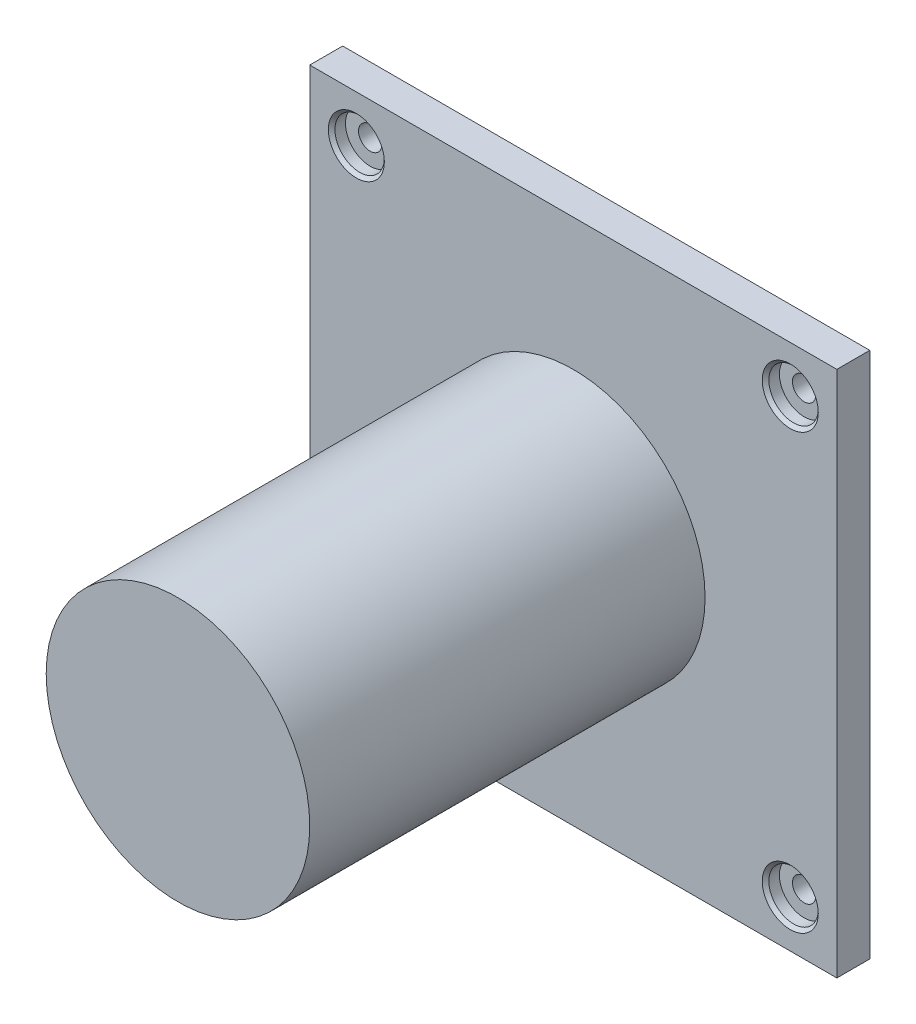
ISO-10303-21;
HEADER;
FILE_DESCRIPTION(('STEP AP214'),'2;1');
FILE_NAME('part.step','',(''),(''),'','','');
FILE_SCHEMA(('AUTOMOTIVE_DESIGN { 1 0 10303 214 1 1 1 1 }'));
ENDSEC;
DATA;
#1=APPLICATION_CONTEXT('core data for automotive mechanical design processes');
#2=APPLICATION_PROTOCOL_DEFINITION('international standard','automotive_design',2000,#1);
#3=PRODUCT_CONTEXT('',#1,'mechanical');
#4=PRODUCT('Part','Part','',(#3));
#5=PRODUCT_RELATED_PRODUCT_CATEGORY('part','',(#4));
#6=PRODUCT_DEFINITION_FORMATION('','',#4);
#7=PRODUCT_DEFINITION_CONTEXT('part definition',#1,'design');
#8=PRODUCT_DEFINITION('design','',#6,#7);
#9=PRODUCT_DEFINITION_SHAPE('','',#8);
#10=(LENGTH_UNIT() NAMED_UNIT(*) SI_UNIT(.MILLI.,.METRE.));
#11=(NAMED_UNIT(*) PLANE_ANGLE_UNIT() SI_UNIT($,.RADIAN.));
#12=(NAMED_UNIT(*) SI_UNIT($,.STERADIAN.) SOLID_ANGLE_UNIT());
#13=UNCERTAINTY_MEASURE_WITH_UNIT(LENGTH_MEASURE(1.E-05),#10,'distance_accuracy_value','');
#14=(GEOMETRIC_REPRESENTATION_CONTEXT(3) GLOBAL_UNCERTAINTY_ASSIGNED_CONTEXT((#13)) GLOBAL_UNIT_ASSIGNED_CONTEXT((#10,
#11,#12)) REPRESENTATION_CONTEXT('',''));
#15=CARTESIAN_POINT('',(0.,0.,0.));
#16=DIRECTION('',(0.,0.,1.));
#17=DIRECTION('',(1.,0.,0.));
#18=AXIS2_PLACEMENT_3D('',#15,#16,#17);
#19=CARTESIAN_POINT('',(0.,0.,6.35));
#20=DIRECTION('',(1.,0.,0.));
#21=DIRECTION('',(0.,0.,-1.));
#22=AXIS2_PLACEMENT_3D('',#19,#20,#21);
#23=PLANE('',#22);
#24=DIRECTION('',(0.,-1.,0.));
#25=VECTOR('',#24,1.);
#26=CARTESIAN_POINT('',(0.,0.,0.));
#27=LINE('',#26,#25);
#28=CARTESIAN_POINT('',(0.,101.6,0.));
#29=VERTEX_POINT('',#28);
#30=CARTESIAN_POINT('',(0.,0.,0.));
#31=VERTEX_POINT('',#30);
#32=EDGE_CURVE('E116',#29,#31,#27,.T.);
#33=ORIENTED_EDGE('',*,*,#32,.T.);
#34=DIRECTION('',(0.,0.,-1.));
#35=VECTOR('',#34,1.);
#36=CARTESIAN_POINT('',(0.,0.,6.35));
#37=LINE('',#36,#35);
#38=CARTESIAN_POINT('',(0.,0.,6.35));
#39=VERTEX_POINT('',#38);
#40=EDGE_CURVE('E48',#39,#31,#37,.T.);
#41=ORIENTED_EDGE('',*,*,#40,.F.);
#42=DIRECTION('',(0.,-1.,0.));
#43=VECTOR('',#42,1.);
#44=CARTESIAN_POINT('',(0.,0.,6.35));
#45=LINE('',#44,#43);
#46=CARTESIAN_POINT('',(0.,101.6,6.35));
#47=VERTEX_POINT('',#46);
#48=EDGE_CURVE('E99',#47,#39,#45,.T.);
#49=ORIENTED_EDGE('',*,*,#48,.F.);
#50=DIRECTION('',(0.,0.,-1.));
#51=VECTOR('',#50,1.);
#52=CARTESIAN_POINT('',(0.,101.6,6.35));
#53=LINE('',#52,#51);
#54=EDGE_CURVE('E112',#47,#29,#53,.T.);
#55=ORIENTED_EDGE('',*,*,#54,.T.);
#56=EDGE_LOOP('',(#33,#41,#49,#55));
#57=FACE_BOUND('',#56,.T.);
#58=ADVANCED_FACE('F45',(#57),#23,.F.);
#59=CARTESIAN_POINT('',(0.,0.,6.35));
#60=DIRECTION('',(0.,1.,0.));
#61=DIRECTION('',(0.,0.,1.));
#62=AXIS2_PLACEMENT_3D('',#59,#60,#61);
#63=PLANE('',#62);
#64=DIRECTION('',(1.,0.,0.));
#65=VECTOR('',#64,1.);
#66=CARTESIAN_POINT('',(0.,0.,0.));
#67=LINE('',#66,#65);
#68=CARTESIAN_POINT('',(101.6,0.,0.));
#69=VERTEX_POINT('',#68);
#70=EDGE_CURVE('E105',#31,#69,#67,.T.);
#71=ORIENTED_EDGE('',*,*,#70,.T.);
#72=DIRECTION('',(0.,0.,-1.));
#73=VECTOR('',#72,1.);
#74=CARTESIAN_POINT('',(101.6,0.,6.35));
#75=LINE('',#74,#73);
#76=CARTESIAN_POINT('',(101.6,0.,6.35));
#77=VERTEX_POINT('',#76);
#78=EDGE_CURVE('E103',#77,#69,#75,.T.);
#79=ORIENTED_EDGE('',*,*,#78,.F.);
#80=DIRECTION('',(1.,0.,0.));
#81=VECTOR('',#80,1.);
#82=CARTESIAN_POINT('',(0.,0.,6.35));
#83=LINE('',#82,#81);
#84=EDGE_CURVE('E94',#39,#77,#83,.T.);
#85=ORIENTED_EDGE('',*,*,#84,.F.);
#86=ORIENTED_EDGE('',*,*,#40,.T.);
#87=EDGE_LOOP('',(#71,#79,#85,#86));
#88=FACE_BOUND('',#87,.T.);
#89=ADVANCED_FACE('F104',(#88),#63,.F.);
#90=CARTESIAN_POINT('',(101.6,0.,6.35));
#91=DIRECTION('',(-1.,0.,0.));
#92=DIRECTION('',(0.,0.,1.));
#93=AXIS2_PLACEMENT_3D('',#90,#91,#92);
#94=PLANE('',#93);
#95=DIRECTION('',(0.,1.,0.));
#96=VECTOR('',#95,1.);
#97=CARTESIAN_POINT('',(101.6,0.,0.));
#98=LINE('',#97,#96);
#99=CARTESIAN_POINT('',(101.6,101.6,0.));
#100=VERTEX_POINT('',#99);
#101=EDGE_CURVE('E80',#69,#100,#98,.T.);
#102=ORIENTED_EDGE('',*,*,#101,.T.);
#103=DIRECTION('',(0.,0.,-1.));
#104=VECTOR('',#103,1.);
#105=CARTESIAN_POINT('',(101.6,101.6,6.35));
#106=LINE('',#105,#104);
#107=CARTESIAN_POINT('',(101.6,101.6,6.35));
#108=VERTEX_POINT('',#107);
#109=EDGE_CURVE('E107',#108,#100,#106,.T.);
#110=ORIENTED_EDGE('',*,*,#109,.F.);
#111=DIRECTION('',(0.,1.,0.));
#112=VECTOR('',#111,1.);
#113=CARTESIAN_POINT('',(101.6,0.,6.35));
#114=LINE('',#113,#112);
#115=EDGE_CURVE('E97',#77,#108,#114,.T.);
#116=ORIENTED_EDGE('',*,*,#115,.F.);
#117=ORIENTED_EDGE('',*,*,#78,.T.);
#118=EDGE_LOOP('',(#102,#110,#116,#117));
#119=FACE_BOUND('',#118,.T.);
#120=ADVANCED_FACE('F108',(#119),#94,.F.);
#121=CARTESIAN_POINT('',(0.,101.6,6.35));
#122=DIRECTION('',(0.,-1.,0.));
#123=DIRECTION('',(0.,0.,-1.));
#124=AXIS2_PLACEMENT_3D('',#121,#122,#123);
#125=PLANE('',#124);
#126=DIRECTION('',(-1.,0.,0.));
#127=VECTOR('',#126,1.);
#128=CARTESIAN_POINT('',(0.,101.6,0.));
#129=LINE('',#128,#127);
#130=EDGE_CURVE('E86',#100,#29,#129,.T.);
#131=ORIENTED_EDGE('',*,*,#130,.T.);
#132=ORIENTED_EDGE('',*,*,#54,.F.);
#133=DIRECTION('',(-1.,0.,0.));
#134=VECTOR('',#133,1.);
#135=CARTESIAN_POINT('',(0.,101.6,6.35));
#136=LINE('',#135,#134);
#137=EDGE_CURVE('E63',#108,#47,#136,.T.);
#138=ORIENTED_EDGE('',*,*,#137,.F.);
#139=ORIENTED_EDGE('',*,*,#109,.T.);
#140=EDGE_LOOP('',(#131,#132,#138,#139));
#141=FACE_BOUND('',#140,.T.);
#142=ADVANCED_FACE('F130',(#141),#125,.F.);
#143=CARTESIAN_POINT('',(0.,0.,6.35));
#144=DIRECTION('',(0.,0.,-1.));
#145=DIRECTION('',(-1.,0.,0.));
#146=AXIS2_PLACEMENT_3D('',#143,#144,#145);
#147=PLANE('',#146);
#148=CARTESIAN_POINT('',(8.98025612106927,92.619743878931,6.35));
#149=DIRECTION('',(0.,0.,1.));
#150=DIRECTION('',(1.,0.,0.));
#151=AXIS2_PLACEMENT_3D('',#148,#149,#150);
#152=CIRCLE('',#151,5.3975);
#153=CARTESIAN_POINT('',(14.3777561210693,92.619743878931,6.35));
#154=VERTEX_POINT('',#153);
#155=EDGE_CURVE('E216',#154,#154,#152,.T.);
#156=ORIENTED_EDGE('',*,*,#155,.F.);
#157=EDGE_LOOP('',(#156));
#158=FACE_BOUND('',#157,.T.);
#159=CARTESIAN_POINT('',(92.6197438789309,92.6197438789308,6.35));
#160=DIRECTION('',(0.,0.,1.));
#161=DIRECTION('',(1.,0.,0.));
#162=AXIS2_PLACEMENT_3D('',#159,#160,#161);
#163=CIRCLE('',#162,5.3975);
#164=CARTESIAN_POINT('',(98.0172438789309,92.6197438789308,6.35));
#165=VERTEX_POINT('',#164);
#166=EDGE_CURVE('E196',#165,#165,#163,.T.);
#167=ORIENTED_EDGE('',*,*,#166,.F.);
#168=EDGE_LOOP('',(#167));
#169=FACE_BOUND('',#168,.T.);
#170=CARTESIAN_POINT('',(8.98025612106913,8.98025612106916,6.35));
#171=DIRECTION('',(0.,0.,1.));
#172=DIRECTION('',(1.,0.,0.));
#173=AXIS2_PLACEMENT_3D('',#170,#171,#172);
#174=CIRCLE('',#173,5.3975);
#175=CARTESIAN_POINT('',(14.3777561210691,8.98025612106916,6.35));
#176=VERTEX_POINT('',#175);
#177=EDGE_CURVE('E176',#176,#176,#174,.T.);
#178=ORIENTED_EDGE('',*,*,#177,.F.);
#179=EDGE_LOOP('',(#178));
#180=FACE_BOUND('',#179,.T.);
#181=CARTESIAN_POINT('',(92.6197438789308,8.9802561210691,6.35));
#182=DIRECTION('',(0.,0.,1.));
#183=DIRECTION('',(1.,0.,0.));
#184=AXIS2_PLACEMENT_3D('',#181,#182,#183);
#185=CIRCLE('',#184,5.3975);
#186=CARTESIAN_POINT('',(98.0172438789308,8.9802561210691,6.35));
#187=VERTEX_POINT('',#186);
#188=EDGE_CURVE('E156',#187,#187,#185,.T.);
#189=ORIENTED_EDGE('',*,*,#188,.F.);
#190=EDGE_LOOP('',(#189));
#191=FACE_BOUND('',#190,.T.);
#192=CARTESIAN_POINT('',(50.8,50.8,6.35));
#193=DIRECTION('',(0.,0.,1.));
#194=DIRECTION('',(1.,0.,0.));
#195=AXIS2_PLACEMENT_3D('',#192,#193,#194);
#196=CIRCLE('',#195,25.4);
#197=CARTESIAN_POINT('',(25.4,50.8,6.34999999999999));
#198=VERTEX_POINT('',#197);
#199=EDGE_CURVE('E11',#198,#198,#196,.T.);
#200=ORIENTED_EDGE('',*,*,#199,.F.);
#201=EDGE_LOOP('',(#200));
#202=FACE_BOUND('',#201,.T.);
#203=ORIENTED_EDGE('',*,*,#48,.T.);
#204=ORIENTED_EDGE('',*,*,#84,.T.);
#205=ORIENTED_EDGE('',*,*,#115,.T.);
#206=ORIENTED_EDGE('',*,*,#137,.T.);
#207=EDGE_LOOP('',(#203,#204,#205,#206));
#208=FACE_BOUND('',#207,.T.);
#209=ADVANCED_FACE('F95',(#158,#169,#180,#191,#202,#208),#147,.F.);
#210=CARTESIAN_POINT('',(0.,0.,0.));
#211=DIRECTION('',(0.,0.,-1.));
#212=DIRECTION('',(-1.,0.,0.));
#213=AXIS2_PLACEMENT_3D('',#210,#211,#212);
#214=PLANE('',#213);
#215=CARTESIAN_POINT('',(8.98025612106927,92.619743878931,0.));
#216=DIRECTION('',(0.,0.,1.));
#217=DIRECTION('',(1.,0.,0.));
#218=AXIS2_PLACEMENT_3D('',#215,#216,#217);
#219=CIRCLE('',#218,2.2479);
#220=CARTESIAN_POINT('',(11.2281561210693,92.619743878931,0.));
#221=VERTEX_POINT('',#220);
#222=EDGE_CURVE('E200',#221,#221,#219,.T.);
#223=ORIENTED_EDGE('',*,*,#222,.T.);
#224=EDGE_LOOP('',(#223));
#225=FACE_BOUND('',#224,.T.);
#226=CARTESIAN_POINT('',(92.6197438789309,92.6197438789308,0.));
#227=DIRECTION('',(0.,0.,1.));
#228=DIRECTION('',(1.,0.,0.));
#229=AXIS2_PLACEMENT_3D('',#226,#227,#228);
#230=CIRCLE('',#229,2.2479);
#231=CARTESIAN_POINT('',(94.8676438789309,92.6197438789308,0.));
#232=VERTEX_POINT('',#231);
#233=EDGE_CURVE('E180',#232,#232,#230,.T.);
#234=ORIENTED_EDGE('',*,*,#233,.T.);
#235=EDGE_LOOP('',(#234));
#236=FACE_BOUND('',#235,.T.);
#237=CARTESIAN_POINT('',(8.98025612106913,8.98025612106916,0.));
#238=DIRECTION('',(0.,0.,1.));
#239=DIRECTION('',(1.,0.,0.));
#240=AXIS2_PLACEMENT_3D('',#237,#238,#239);
#241=CIRCLE('',#240,2.2479);
#242=CARTESIAN_POINT('',(11.2281561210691,8.98025612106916,0.));
#243=VERTEX_POINT('',#242);
#244=EDGE_CURVE('E160',#243,#243,#241,.T.);
#245=ORIENTED_EDGE('',*,*,#244,.T.);
#246=EDGE_LOOP('',(#245));
#247=FACE_BOUND('',#246,.T.);
#248=CARTESIAN_POINT('',(92.6197438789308,8.9802561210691,0.));
#249=DIRECTION('',(0.,0.,1.));
#250=DIRECTION('',(1.,0.,0.));
#251=AXIS2_PLACEMENT_3D('',#248,#249,#250);
#252=CIRCLE('',#251,2.2479);
#253=CARTESIAN_POINT('',(94.8676438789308,8.9802561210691,0.));
#254=VERTEX_POINT('',#253);
#255=EDGE_CURVE('E140',#254,#254,#252,.T.);
#256=ORIENTED_EDGE('',*,*,#255,.T.);
#257=EDGE_LOOP('',(#256));
#258=FACE_BOUND('',#257,.T.);
#259=ORIENTED_EDGE('',*,*,#32,.F.);
#260=ORIENTED_EDGE('',*,*,#130,.F.);
#261=ORIENTED_EDGE('',*,*,#101,.F.);
#262=ORIENTED_EDGE('',*,*,#70,.F.);
#263=EDGE_LOOP('',(#259,#260,#261,#262));
#264=FACE_BOUND('',#263,.T.);
#265=ADVANCED_FACE('F133',(#225,#236,#247,#258,#264),#214,.T.);
#266=CARTESIAN_POINT('',(50.8,50.8,82.55));
#267=DIRECTION('',(0.,0.,-1.));
#268=DIRECTION('',(-1.,0.,0.));
#269=AXIS2_PLACEMENT_3D('',#266,#267,#268);
#270=CYLINDRICAL_SURFACE('',#269,25.4);
#271=CARTESIAN_POINT('',(50.8,50.8,82.55));
#272=DIRECTION('',(0.,0.,1.));
#273=DIRECTION('',(1.,0.,0.));
#274=AXIS2_PLACEMENT_3D('',#271,#272,#273);
#275=CIRCLE('',#274,25.4);
#276=CARTESIAN_POINT('',(25.4,50.8,82.55));
#277=VERTEX_POINT('',#276);
#278=EDGE_CURVE('E120',#277,#277,#275,.T.);
#279=CARTESIAN_POINT('',(25.4,50.8,82.55));
#280=CARTESIAN_POINT('',(25.4,50.8,81.75625));
#281=CARTESIAN_POINT('',(25.4,50.8,80.9625));
#282=CARTESIAN_POINT('',(25.4,50.8,79.375));
#283=CARTESIAN_POINT('',(25.4,50.8,78.58125));
#284=CARTESIAN_POINT('',(25.4,50.8,76.99375));
#285=CARTESIAN_POINT('',(25.4,50.8,76.2));
#286=CARTESIAN_POINT('',(25.4,50.8,74.6125));
#287=CARTESIAN_POINT('',(25.4,50.8,73.81875));
#288=CARTESIAN_POINT('',(25.4,50.8,72.23125));
#289=CARTESIAN_POINT('',(25.4,50.8,71.4375));
#290=CARTESIAN_POINT('',(25.4,50.8,69.85));
#291=CARTESIAN_POINT('',(25.4,50.8,69.05625));
#292=CARTESIAN_POINT('',(25.4,50.8,67.46875));
#293=CARTESIAN_POINT('',(25.4,50.8,66.675));
#294=CARTESIAN_POINT('',(25.4,50.8,65.0875));
#295=CARTESIAN_POINT('',(25.4,50.8,64.29375));
#296=CARTESIAN_POINT('',(25.4,50.8,62.70625));
#297=CARTESIAN_POINT('',(25.4,50.8,61.9125));
#298=CARTESIAN_POINT('',(25.4,50.8,60.325));
#299=CARTESIAN_POINT('',(25.4,50.8,59.53125));
#300=CARTESIAN_POINT('',(25.4,50.8,57.94375));
#301=CARTESIAN_POINT('',(25.4,50.8,57.15));
#302=CARTESIAN_POINT('',(25.4,50.8,55.5625));
#303=CARTESIAN_POINT('',(25.4,50.8,54.76875));
#304=CARTESIAN_POINT('',(25.4,50.8,53.18125));
#305=CARTESIAN_POINT('',(25.4,50.8,52.3875));
#306=CARTESIAN_POINT('',(25.4,50.8,50.8));
#307=CARTESIAN_POINT('',(25.4,50.8,50.00625));
#308=CARTESIAN_POINT('',(25.4,50.8,48.41875));
#309=CARTESIAN_POINT('',(25.4,50.8,47.625));
#310=CARTESIAN_POINT('',(25.4,50.8,46.0375));
#311=CARTESIAN_POINT('',(25.4,50.8,45.24375));
#312=CARTESIAN_POINT('',(25.4,50.8,43.65625));
#313=CARTESIAN_POINT('',(25.4,50.8,42.8625));
#314=CARTESIAN_POINT('',(25.4,50.8,41.275));
#315=CARTESIAN_POINT('',(25.4,50.8,40.48125));
#316=CARTESIAN_POINT('',(25.4,50.8,38.89375));
#317=CARTESIAN_POINT('',(25.4,50.8,38.1));
#318=CARTESIAN_POINT('',(25.4,50.8,36.5125));
#319=CARTESIAN_POINT('',(25.4,50.8,35.71875));
#320=CARTESIAN_POINT('',(25.4,50.8,34.13125));
#321=CARTESIAN_POINT('',(25.4,50.8,33.3375));
#322=CARTESIAN_POINT('',(25.4,50.8,31.75));
#323=CARTESIAN_POINT('',(25.4,50.8,30.95625));
#324=CARTESIAN_POINT('',(25.4,50.8,29.36875));
#325=CARTESIAN_POINT('',(25.4,50.8,28.575));
#326=CARTESIAN_POINT('',(25.4,50.8,26.9875));
#327=CARTESIAN_POINT('',(25.4,50.8,26.19375));
#328=CARTESIAN_POINT('',(25.4,50.8,24.60625));
#329=CARTESIAN_POINT('',(25.4,50.8,23.8125));
#330=CARTESIAN_POINT('',(25.4,50.8,22.225));
#331=CARTESIAN_POINT('',(25.4,50.8,21.43125));
#332=CARTESIAN_POINT('',(25.4,50.8,19.84375));
#333=CARTESIAN_POINT('',(25.4,50.8,19.05));
#334=CARTESIAN_POINT('',(25.4,50.8,17.4625));
#335=CARTESIAN_POINT('',(25.4,50.8,16.66875));
#336=CARTESIAN_POINT('',(25.4,50.8,15.08125));
#337=CARTESIAN_POINT('',(25.4,50.8,14.2875));
#338=CARTESIAN_POINT('',(25.4,50.8,12.7));
#339=CARTESIAN_POINT('',(25.4,50.8,11.90625));
#340=CARTESIAN_POINT('',(25.4,50.8,10.31875));
#341=CARTESIAN_POINT('',(25.4,50.8,9.525));
#342=CARTESIAN_POINT('',(25.4,50.8,7.93749999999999));
#343=CARTESIAN_POINT('',(25.4,50.8,7.14375));
#344=CARTESIAN_POINT('',(25.4,50.8,6.34999999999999));
#345=B_SPLINE_CURVE_WITH_KNOTS('',3,(#279,#280,#281,#282,#283,#284,#285,#286,#287,#288,#289,
#290,#291,#292,#293,#294,#295,#296,#297,#298,#299,#300,#301,#302,#303,#304,#305,#306,#307,#308,
#309,#310,#311,#312,#313,#314,#315,#316,#317,#318,#319,#320,#321,#322,#323,#324,#325,#326,#327,
#328,#329,#330,#331,#332,#333,#334,#335,#336,#337,#338,#339,#340,#341,#342,#343,#344),
.UNSPECIFIED.,.F.,.F.,(4,2,2,2,2,2,2,2,2,2,2,2,2,2,2,2,2,2,2,2,2,2,2,2,2,2,2,2,2,2,2,2,4),(0.,
2.38125,4.7625,7.14375,9.52500000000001,11.90625,14.2875,16.66875,19.05,21.43125,23.8125,
26.19375,28.575,30.95625,33.3375,35.71875,38.1,40.48125,42.8625,45.24375,47.625,50.00625,
52.3875,54.76875,57.15,59.53125,61.9125,64.29375,66.675,69.05625,71.4375,73.81875,76.2),.UNSPECIFIED.);
#346=EDGE_CURVE('BSEAM234',#277,#198,#345,.T.);
#347=ORIENTED_EDGE('',*,*,#278,.F.);
#348=ORIENTED_EDGE('',*,*,#199,.T.);
#349=ORIENTED_EDGE('',*,*,#346,.T.);
#350=ORIENTED_EDGE('',*,*,#346,.F.);
#351=EDGE_LOOP('',(#347,#349,#348,#350));
#352=FACE_BOUND('',#351,.T.);
#353=ADVANCED_FACE('F234',(#352),#270,.T.);
#354=CARTESIAN_POINT('',(50.8,50.8,82.55));
#355=DIRECTION('',(0.,0.,1.));
#356=DIRECTION('',(1.,0.,0.));
#357=AXIS2_PLACEMENT_3D('',#354,#355,#356);
#358=PLANE('',#357);
#359=ORIENTED_EDGE('',*,*,#278,.T.);
#360=EDGE_LOOP('',(#359));
#361=FACE_BOUND('',#360,.T.);
#362=ADVANCED_FACE('F236',(#361),#358,.T.);
#363=CARTESIAN_POINT('',(92.6197438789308,8.9802561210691,6.35));
#364=DIRECTION('',(0.,0.,1.));
#365=DIRECTION('',(1.,0.,0.));
#366=AXIS2_PLACEMENT_3D('',#363,#364,#365);
#367=CYLINDRICAL_SURFACE('',#366,2.2479);
#368=ORIENTED_EDGE('',*,*,#255,.F.);
#369=EDGE_LOOP('',(#368));
#370=FACE_BOUND('',#369,.T.);
#371=CARTESIAN_POINT('',(92.6197438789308,8.9802561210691,3.683));
#372=DIRECTION('',(0.,0.,1.));
#373=DIRECTION('',(1.,0.,0.));
#374=AXIS2_PLACEMENT_3D('',#371,#372,#373);
#375=CIRCLE('',#374,2.2479);
#376=CARTESIAN_POINT('',(94.8676438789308,8.9802561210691,3.683));
#377=VERTEX_POINT('',#376);
#378=EDGE_CURVE('E144',#377,#377,#375,.T.);
#379=ORIENTED_EDGE('',*,*,#378,.T.);
#380=EDGE_LOOP('',(#379));
#381=FACE_BOUND('',#380,.T.);
#382=ADVANCED_FACE('F243',(#370,#381),#367,.F.);
#383=CARTESIAN_POINT('',(97.3822438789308,8.9802561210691,3.683));
#384=DIRECTION('',(0.,0.,-1.));
#385=DIRECTION('',(-1.,0.,0.));
#386=AXIS2_PLACEMENT_3D('',#383,#384,#385);
#387=PLANE('',#386);
#388=ORIENTED_EDGE('',*,*,#378,.F.);
#389=EDGE_LOOP('',(#388));
#390=FACE_BOUND('',#389,.T.);
#391=CARTESIAN_POINT('',(92.6197438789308,8.9802561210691,3.683));
#392=DIRECTION('',(0.,0.,1.));
#393=DIRECTION('',(1.,0.,0.));
#394=AXIS2_PLACEMENT_3D('',#391,#392,#393);
#395=CIRCLE('',#394,4.7625);
#396=CARTESIAN_POINT('',(97.3822438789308,8.9802561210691,3.683));
#397=VERTEX_POINT('',#396);
#398=EDGE_CURVE('E148',#397,#397,#395,.T.);
#399=ORIENTED_EDGE('',*,*,#398,.T.);
#400=EDGE_LOOP('',(#399));
#401=FACE_BOUND('',#400,.T.);
#402=ADVANCED_FACE('F303',(#390,#401),#387,.F.);
#403=CARTESIAN_POINT('',(92.6197438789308,8.9802561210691,6.35));
#404=DIRECTION('',(0.,0.,1.));
#405=DIRECTION('',(1.,0.,0.));
#406=AXIS2_PLACEMENT_3D('',#403,#404,#405);
#407=CYLINDRICAL_SURFACE('',#406,4.7625);
#408=ORIENTED_EDGE('',*,*,#398,.F.);
#409=EDGE_LOOP('',(#408));
#410=FACE_BOUND('',#409,.T.);
#411=CARTESIAN_POINT('',(92.6197438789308,8.9802561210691,5.715));
#412=DIRECTION('',(0.,0.,1.));
#413=DIRECTION('',(1.,0.,0.));
#414=AXIS2_PLACEMENT_3D('',#411,#412,#413);
#415=CIRCLE('',#414,4.7625);
#416=CARTESIAN_POINT('',(97.3822438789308,8.9802561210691,5.715));
#417=VERTEX_POINT('',#416);
#418=EDGE_CURVE('E152',#417,#417,#415,.T.);
#419=ORIENTED_EDGE('',*,*,#418,.T.);
#420=EDGE_LOOP('',(#419));
#421=FACE_BOUND('',#420,.T.);
#422=ADVANCED_FACE('F312',(#410,#421),#407,.F.);
#423=CARTESIAN_POINT('',(92.6197438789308,8.9802561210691,6.35));
#424=DIRECTION('',(0.,0.,1.));
#425=DIRECTION('',(1.,0.,0.));
#426=AXIS2_PLACEMENT_3D('',#423,#424,#425);
#427=CONICAL_SURFACE('',#426,5.3975,0.785398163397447);
#428=ORIENTED_EDGE('',*,*,#418,.F.);
#429=EDGE_LOOP('',(#428));
#430=FACE_BOUND('',#429,.T.);
#431=ORIENTED_EDGE('',*,*,#188,.T.);
#432=EDGE_LOOP('',(#431));
#433=FACE_BOUND('',#432,.T.);
#434=ADVANCED_FACE('F321',(#430,#433),#427,.F.);
#435=CARTESIAN_POINT('',(8.98025612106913,8.98025612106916,6.35));
#436=DIRECTION('',(0.,0.,1.));
#437=DIRECTION('',(1.,0.,0.));
#438=AXIS2_PLACEMENT_3D('',#435,#436,#437);
#439=CYLINDRICAL_SURFACE('',#438,2.2479);
#440=ORIENTED_EDGE('',*,*,#244,.F.);
#441=EDGE_LOOP('',(#440));
#442=FACE_BOUND('',#441,.T.);
#443=CARTESIAN_POINT('',(8.98025612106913,8.98025612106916,3.683));
#444=DIRECTION('',(0.,0.,1.));
#445=DIRECTION('',(1.,0.,0.));
#446=AXIS2_PLACEMENT_3D('',#443,#444,#445);
#447=CIRCLE('',#446,2.2479);
#448=CARTESIAN_POINT('',(11.2281561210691,8.98025612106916,3.683));
#449=VERTEX_POINT('',#448);
#450=EDGE_CURVE('E164',#449,#449,#447,.T.);
#451=ORIENTED_EDGE('',*,*,#450,.T.);
#452=EDGE_LOOP('',(#451));
#453=FACE_BOUND('',#452,.T.);
#454=ADVANCED_FACE('F330',(#442,#453),#439,.F.);
#455=CARTESIAN_POINT('',(13.7427561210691,8.98025612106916,3.683));
#456=DIRECTION('',(0.,0.,-1.));
#457=DIRECTION('',(-1.,0.,0.));
#458=AXIS2_PLACEMENT_3D('',#455,#456,#457);
#459=PLANE('',#458);
#460=ORIENTED_EDGE('',*,*,#450,.F.);
#461=EDGE_LOOP('',(#460));
#462=FACE_BOUND('',#461,.T.);
#463=CARTESIAN_POINT('',(8.98025612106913,8.98025612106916,3.683));
#464=DIRECTION('',(0.,0.,1.));
#465=DIRECTION('',(1.,0.,0.));
#466=AXIS2_PLACEMENT_3D('',#463,#464,#465);
#467=CIRCLE('',#466,4.7625);
#468=CARTESIAN_POINT('',(13.7427561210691,8.98025612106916,3.683));
#469=VERTEX_POINT('',#468);
#470=EDGE_CURVE('E168',#469,#469,#467,.T.);
#471=ORIENTED_EDGE('',*,*,#470,.T.);
#472=EDGE_LOOP('',(#471));
#473=FACE_BOUND('',#472,.T.);
#474=ADVANCED_FACE('F339',(#462,#473),#459,.F.);
#475=CARTESIAN_POINT('',(8.98025612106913,8.98025612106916,6.35));
#476=DIRECTION('',(0.,0.,1.));
#477=DIRECTION('',(1.,0.,0.));
#478=AXIS2_PLACEMENT_3D('',#475,#476,#477);
#479=CYLINDRICAL_SURFACE('',#478,4.7625);
#480=ORIENTED_EDGE('',*,*,#470,.F.);
#481=EDGE_LOOP('',(#480));
#482=FACE_BOUND('',#481,.T.);
#483=CARTESIAN_POINT('',(8.98025612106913,8.98025612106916,5.715));
#484=DIRECTION('',(0.,0.,1.));
#485=DIRECTION('',(1.,0.,0.));
#486=AXIS2_PLACEMENT_3D('',#483,#484,#485);
#487=CIRCLE('',#486,4.7625);
#488=CARTESIAN_POINT('',(13.7427561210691,8.98025612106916,5.715));
#489=VERTEX_POINT('',#488);
#490=EDGE_CURVE('E172',#489,#489,#487,.T.);
#491=ORIENTED_EDGE('',*,*,#490,.T.);
#492=EDGE_LOOP('',(#491));
#493=FACE_BOUND('',#492,.T.);
#494=ADVANCED_FACE('F348',(#482,#493),#479,.F.);
#495=CARTESIAN_POINT('',(8.98025612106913,8.98025612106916,6.35));
#496=DIRECTION('',(0.,0.,1.));
#497=DIRECTION('',(1.,0.,0.));
#498=AXIS2_PLACEMENT_3D('',#495,#496,#497);
#499=CONICAL_SURFACE('',#498,5.3975,0.785398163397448);
#500=ORIENTED_EDGE('',*,*,#490,.F.);
#501=EDGE_LOOP('',(#500));
#502=FACE_BOUND('',#501,.T.);
#503=ORIENTED_EDGE('',*,*,#177,.T.);
#504=EDGE_LOOP('',(#503));
#505=FACE_BOUND('',#504,.T.);
#506=ADVANCED_FACE('F357',(#502,#505),#499,.F.);
#507=CARTESIAN_POINT('',(92.6197438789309,92.6197438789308,6.35));
#508=DIRECTION('',(0.,0.,1.));
#509=DIRECTION('',(1.,0.,0.));
#510=AXIS2_PLACEMENT_3D('',#507,#508,#509);
#511=CYLINDRICAL_SURFACE('',#510,2.2479);
#512=ORIENTED_EDGE('',*,*,#233,.F.);
#513=EDGE_LOOP('',(#512));
#514=FACE_BOUND('',#513,.T.);
#515=CARTESIAN_POINT('',(92.6197438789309,92.6197438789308,3.683));
#516=DIRECTION('',(0.,0.,1.));
#517=DIRECTION('',(1.,0.,0.));
#518=AXIS2_PLACEMENT_3D('',#515,#516,#517);
#519=CIRCLE('',#518,2.2479);
#520=CARTESIAN_POINT('',(94.8676438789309,92.6197438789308,3.683));
#521=VERTEX_POINT('',#520);
#522=EDGE_CURVE('E184',#521,#521,#519,.T.);
#523=ORIENTED_EDGE('',*,*,#522,.T.);
#524=EDGE_LOOP('',(#523));
#525=FACE_BOUND('',#524,.T.);
#526=ADVANCED_FACE('F366',(#514,#525),#511,.F.);
#527=CARTESIAN_POINT('',(97.3822438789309,92.6197438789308,3.683));
#528=DIRECTION('',(0.,0.,-1.));
#529=DIRECTION('',(-1.,0.,0.));
#530=AXIS2_PLACEMENT_3D('',#527,#528,#529);
#531=PLANE('',#530);
#532=ORIENTED_EDGE('',*,*,#522,.F.);
#533=EDGE_LOOP('',(#532));
#534=FACE_BOUND('',#533,.T.);
#535=CARTESIAN_POINT('',(92.6197438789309,92.6197438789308,3.683));
#536=DIRECTION('',(0.,0.,1.));
#537=DIRECTION('',(1.,0.,0.));
#538=AXIS2_PLACEMENT_3D('',#535,#536,#537);
#539=CIRCLE('',#538,4.7625);
#540=CARTESIAN_POINT('',(97.3822438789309,92.6197438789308,3.683));
#541=VERTEX_POINT('',#540);
#542=EDGE_CURVE('E188',#541,#541,#539,.T.);
#543=ORIENTED_EDGE('',*,*,#542,.T.);
#544=EDGE_LOOP('',(#543));
#545=FACE_BOUND('',#544,.T.);
#546=ADVANCED_FACE('F375',(#534,#545),#531,.F.);
#547=CARTESIAN_POINT('',(92.6197438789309,92.6197438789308,6.35));
#548=DIRECTION('',(0.,0.,1.));
#549=DIRECTION('',(1.,0.,0.));
#550=AXIS2_PLACEMENT_3D('',#547,#548,#549);
#551=CYLINDRICAL_SURFACE('',#550,4.7625);
#552=ORIENTED_EDGE('',*,*,#542,.F.);
#553=EDGE_LOOP('',(#552));
#554=FACE_BOUND('',#553,.T.);
#555=CARTESIAN_POINT('',(92.6197438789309,92.6197438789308,5.715));
#556=DIRECTION('',(0.,0.,1.));
#557=DIRECTION('',(1.,0.,0.));
#558=AXIS2_PLACEMENT_3D('',#555,#556,#557);
#559=CIRCLE('',#558,4.7625);
#560=CARTESIAN_POINT('',(97.3822438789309,92.6197438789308,5.715));
#561=VERTEX_POINT('',#560);
#562=EDGE_CURVE('E192',#561,#561,#559,.T.);
#563=ORIENTED_EDGE('',*,*,#562,.T.);
#564=EDGE_LOOP('',(#563));
#565=FACE_BOUND('',#564,.T.);
#566=ADVANCED_FACE('F384',(#554,#565),#551,.F.);
#567=CARTESIAN_POINT('',(92.6197438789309,92.6197438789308,6.35));
#568=DIRECTION('',(0.,0.,1.));
#569=DIRECTION('',(1.,0.,0.));
#570=AXIS2_PLACEMENT_3D('',#567,#568,#569);
#571=CONICAL_SURFACE('',#570,5.3975,0.785398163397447);
#572=ORIENTED_EDGE('',*,*,#562,.F.);
#573=EDGE_LOOP('',(#572));
#574=FACE_BOUND('',#573,.T.);
#575=ORIENTED_EDGE('',*,*,#166,.T.);
#576=EDGE_LOOP('',(#575));
#577=FACE_BOUND('',#576,.T.);
#578=ADVANCED_FACE('F393',(#574,#577),#571,.F.);
#579=CARTESIAN_POINT('',(8.98025612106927,92.619743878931,6.35));
#580=DIRECTION('',(0.,0.,1.));
#581=DIRECTION('',(1.,0.,0.));
#582=AXIS2_PLACEMENT_3D('',#579,#580,#581);
#583=CYLINDRICAL_SURFACE('',#582,2.2479);
#584=ORIENTED_EDGE('',*,*,#222,.F.);
#585=EDGE_LOOP('',(#584));
#586=FACE_BOUND('',#585,.T.);
#587=CARTESIAN_POINT('',(8.98025612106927,92.619743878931,3.683));
#588=DIRECTION('',(0.,0.,1.));
#589=DIRECTION('',(1.,0.,0.));
#590=AXIS2_PLACEMENT_3D('',#587,#588,#589);
#591=CIRCLE('',#590,2.2479);
#592=CARTESIAN_POINT('',(11.2281561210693,92.619743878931,3.683));
#593=VERTEX_POINT('',#592);
#594=EDGE_CURVE('E204',#593,#593,#591,.T.);
#595=ORIENTED_EDGE('',*,*,#594,.T.);
#596=EDGE_LOOP('',(#595));
#597=FACE_BOUND('',#596,.T.);
#598=ADVANCED_FACE('F402',(#586,#597),#583,.F.);
#599=CARTESIAN_POINT('',(13.7427561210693,92.619743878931,3.683));
#600=DIRECTION('',(0.,0.,-1.));
#601=DIRECTION('',(-1.,0.,0.));
#602=AXIS2_PLACEMENT_3D('',#599,#600,#601);
#603=PLANE('',#602);
#604=ORIENTED_EDGE('',*,*,#594,.F.);
#605=EDGE_LOOP('',(#604));
#606=FACE_BOUND('',#605,.T.);
#607=CARTESIAN_POINT('',(8.98025612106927,92.619743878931,3.683));
#608=DIRECTION('',(0.,0.,1.));
#609=DIRECTION('',(1.,0.,0.));
#610=AXIS2_PLACEMENT_3D('',#607,#608,#609);
#611=CIRCLE('',#610,4.7625);
#612=CARTESIAN_POINT('',(13.7427561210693,92.619743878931,3.683));
#613=VERTEX_POINT('',#612);
#614=EDGE_CURVE('E208',#613,#613,#611,.T.);
#615=ORIENTED_EDGE('',*,*,#614,.T.);
#616=EDGE_LOOP('',(#615));
#617=FACE_BOUND('',#616,.T.);
#618=ADVANCED_FACE('F411',(#606,#617),#603,.F.);
#619=CARTESIAN_POINT('',(8.98025612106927,92.619743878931,6.35));
#620=DIRECTION('',(0.,0.,1.));
#621=DIRECTION('',(1.,0.,0.));
#622=AXIS2_PLACEMENT_3D('',#619,#620,#621);
#623=CYLINDRICAL_SURFACE('',#622,4.7625);
#624=ORIENTED_EDGE('',*,*,#614,.F.);
#625=EDGE_LOOP('',(#624));
#626=FACE_BOUND('',#625,.T.);
#627=CARTESIAN_POINT('',(8.98025612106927,92.619743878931,5.715));
#628=DIRECTION('',(0.,0.,1.));
#629=DIRECTION('',(1.,0.,0.));
#630=AXIS2_PLACEMENT_3D('',#627,#628,#629);
#631=CIRCLE('',#630,4.7625);
#632=CARTESIAN_POINT('',(13.7427561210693,92.619743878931,5.715));
#633=VERTEX_POINT('',#632);
#634=EDGE_CURVE('E212',#633,#633,#631,.T.);
#635=ORIENTED_EDGE('',*,*,#634,.T.);
#636=EDGE_LOOP('',(#635));
#637=FACE_BOUND('',#636,.T.);
#638=ADVANCED_FACE('F420',(#626,#637),#623,.F.);
#639=CARTESIAN_POINT('',(8.98025612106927,92.619743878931,6.35));
#640=DIRECTION('',(0.,0.,1.));
#641=DIRECTION('',(1.,0.,0.));
#642=AXIS2_PLACEMENT_3D('',#639,#640,#641);
#643=CONICAL_SURFACE('',#642,5.3975,0.785398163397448);
#644=ORIENTED_EDGE('',*,*,#634,.F.);
#645=EDGE_LOOP('',(#644));
#646=FACE_BOUND('',#645,.T.);
#647=ORIENTED_EDGE('',*,*,#155,.T.);
#648=EDGE_LOOP('',(#647));
#649=FACE_BOUND('',#648,.T.);
#650=ADVANCED_FACE('F221',(#646,#649),#643,.F.);
#651=CLOSED_SHELL('',(#58,#89,#120,#142,#209,#265,#353,#362,#382,#402,#422,#434,#454,#474,#494,
#506,#526,#546,#566,#578,#598,#618,#638,#650));
#652=MANIFOLD_SOLID_BREP('B2',#651);
#653=ADVANCED_BREP_SHAPE_REPRESENTATION('',(#18,#652),#14);
#654=SHAPE_DEFINITION_REPRESENTATION(#9,#653);
ENDSEC;
END-ISO-10303-21;
